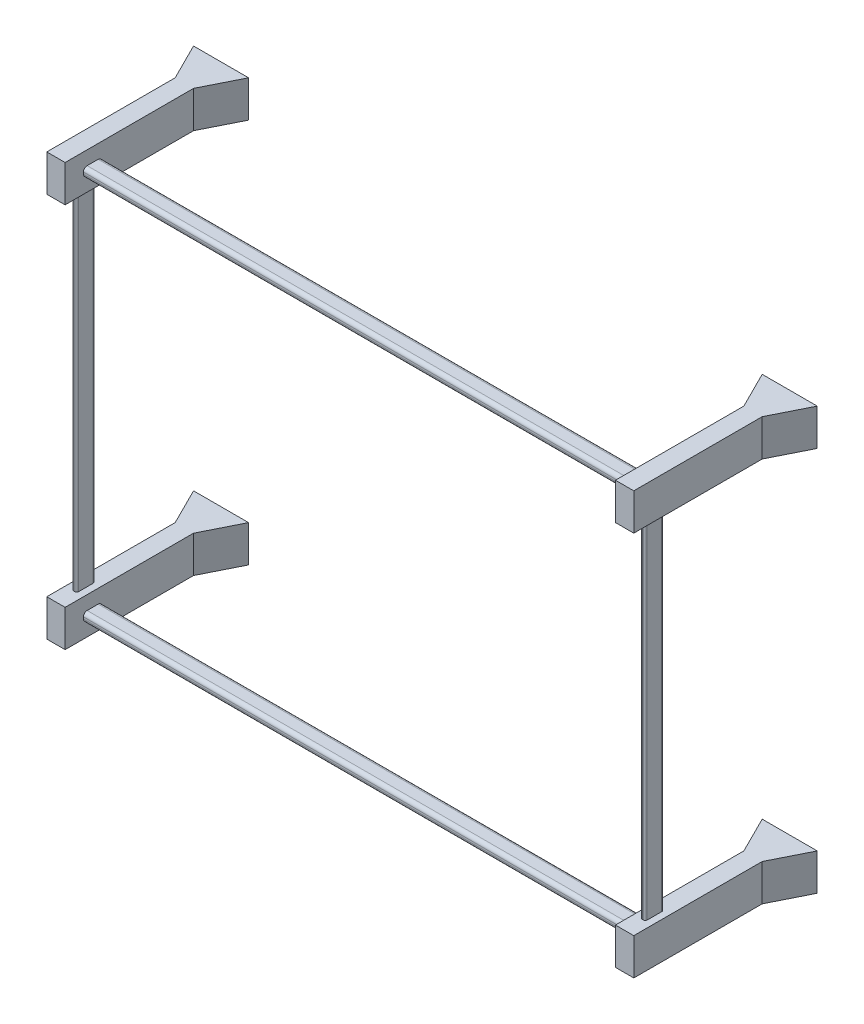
from build123d import *

# Parameters (mm, degrees)
SKETCH1_W                       = 214.285714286
SKETCH1_H                       = 142.857142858
BOSS_EXTRUDE1_DEPTH             = 642.857142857
CUT_EXTRUDE1_DEPTH              = 656.627133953
CUT_EXTRUDE1_DEPTH_BACK         = 656.627133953
SKETCH2_OUTSIDE_W               = 354.792
SKETCH2_OUTSIDE_H               = 783.363
BOSS_EXTRUDE2_DEPTH             = 2142.857142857
SKETCH4_W                       = 642.857142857
SKETCH4_H                       = 142.857142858
BOSS_EXTRUDE3_DEPTH             = 71.428571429
BOSS_EXTRUDE4_REACH             = 2343.125
BOSS_EXTRUDE4_DIRECTION_2_REACH = 2343.125
BOSS_EXTRUDE5_DEPTH             = 1357.14
MIRROR4_COPY_1_SKETCH_W         = 642.857142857
MIRROR4_COPY_1_SKETCH_H         = 142.857142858
MIRROR4_COPY_1_DEPTH            = 71.428571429
MIRROR4_COPY_2_REACH            = 2343.125
MIRROR4_COPY_3_REACH            = 2343.125
MIRROR4_COPY_4_SKETCH_W         = 642.857142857
MIRROR4_COPY_4_SKETCH_H         = 142.857142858
MIRROR4_COPY_4_DEPTH            = 71.428571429
MIRROR4_COPY_5_REACH            = 2343.125
MIRROR4_COPY_6_REACH            = 2343.125


with BuildPart() as part:
    # Sketch1 → Boss-Extrude1 (new body)
    with BuildSketch(Plane.XY):
        Rectangle(SKETCH1_W, SKETCH1_H)
    extrude(amount=BOSS_EXTRUDE1_DEPTH)

    # Sketch2 outside → Cut-Extrude1 (cut, two sides: drawn at the far end of the back side and taken through both)
    with BuildSketch(Plane(origin=(0, 0, 0), x_dir=(1, 0, 0), z_dir=(0, 1, 0)).offset(-CUT_EXTRUDE1_DEPTH_BACK)):
        with Locations((0, -321.4285)):
            Rectangle(SKETCH2_OUTSIDE_W, SKETCH2_OUTSIDE_H)
        Polygon((-107.142857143, 0), (107.142857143, 0), (35.714285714, -142.857142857), (35.714285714, -642.857142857), (-35.714285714, -642.857142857), (-35.714285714, -142.857142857), align=None, mode=Mode.SUBTRACT)
    extrude(amount=CUT_EXTRUDE1_DEPTH + CUT_EXTRUDE1_DEPTH_BACK, mode=Mode.SUBTRACT)


with BuildPart() as boss_extrude2_tool:
    # Sketch3 → Boss-Extrude2 (new body)
    with BuildSketch(Plane(origin=(35.71429, 0, 0), x_dir=(0, 0, -1), z_dir=(1, 0, 0))):
        with BuildLine():
            Line((-514.285714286, -17.857142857), (-557.142857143, -17.857142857))
            ThreePointArc((-557.142857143, -17.857142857), (-567.244382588, -13.672954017), (-571.428571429, -3.571428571))
            Line((-571.428571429, -3.571428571), (-571.428571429, 3.571428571))
            ThreePointArc((-571.428571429, 3.571428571), (-567.244382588, 13.672954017), (-557.142857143, 17.857142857))
            Line((-557.142857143, 17.857142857), (-514.285714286, 17.857142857))
            ThreePointArc((-514.285714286, 17.857142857), (-504.18418884, 13.672954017), (-500, 3.571428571))
            Line((-500, 3.571428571), (-500, -3.571428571))
            ThreePointArc((-500, -3.571428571), (-504.18418884, -13.672954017), (-514.285714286, -17.857142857))
        make_face()
    boss_extrude2 = extrude(amount=BOSS_EXTRUDE2_DEPTH)


with BuildPart() as part_1:
    add(part.part)


with BuildPart() as part_2:
    # Boss-Extrude2: joined with boss_extrude2_tool
    add(part_1.part.fuse(boss_extrude2_tool.part, tol=0.00001))

    # Sketch4 → Boss-Extrude3 (add)
    with BuildSketch(Plane(origin=(2178.57143, 0, 0), x_dir=(0, 0, -1), z_dir=(1, 0, 0))):
        with Locations((-321.428571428, 0)):
            Rectangle(SKETCH4_W, SKETCH4_H)
    boss_extrude3 = extrude(amount=BOSS_EXTRUDE3_DEPTH)

    # Boss-Extrude4: up to this face of the body (flat: up to its plane)
    boss_extrude4_end = Plane(part_2.part.faces().sort_by_distance((2214.285715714, 71.428571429, 321.428571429))[0])
    # Sketch5 → Boss-Extrude4 (add, up to the picked face)
    with BuildSketch(Plane(origin=(0, 0, 0), x_dir=(1, 0, 0), z_dir=(0, 1, 0)), mode=Mode.PRIVATE) as boss_extrude4_sk1:
        Polygon((2250.000001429, 0), (2250.000001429, -142.857142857), (2321.428572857, 0), align=None)
    boss_extrude4_tool1 = split(extrude(boss_extrude4_sk1.sketch, amount=BOSS_EXTRUDE4_REACH, mode=Mode.PRIVATE), bisect_by=boss_extrude4_end, keep=Keep.BOTH, mode=Mode.PRIVATE)
    # Sketch5 → Boss-Extrude4 (add, up to the picked face)
    with BuildSketch(Plane(origin=(0, 0, 0), x_dir=(1, 0, 0), z_dir=(0, 1, 0)), mode=Mode.PRIVATE) as boss_extrude4_sk2:
        Polygon((2178.57143, -142.857142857), (2107.142858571, 0), (2178.57143, 0), align=None)
    boss_extrude4_tool2 = split(extrude(boss_extrude4_sk2.sketch, amount=BOSS_EXTRUDE4_REACH, mode=Mode.PRIVATE), bisect_by=boss_extrude4_end, keep=Keep.BOTH, mode=Mode.PRIVATE)
    boss_extrude4_1 = boss_extrude4_tool1.solids().sort_by(Axis((2273.809525, 0, 47.619048), (0, 1, 0)))[0]
    add(boss_extrude4_1)
    boss_extrude4_2 = boss_extrude4_tool2.solids().sort_by(Axis((2154.761906, 0, 47.619048), (0, 1, 0)))[0]
    add(boss_extrude4_2)
    boss_extrude4 = boss_extrude4_1 + boss_extrude4_2  # Boss-Extrude4 as one shape, for the pattern or mirror that repeats it

    # Boss-Extrude4 direction 2: up to this face of the body (flat: up to its plane)
    boss_extrude4_direction_2_end = Plane(part_2.part.faces().sort_by_distance((2214.285715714, -71.428571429, 321.428571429))[0])
    # Sketch5 → Boss-Extrude4 direction 2 (add, up to the picked face)
    with BuildSketch(Plane(origin=(0, 0, 0), x_dir=(1, 0, 0), z_dir=(0, 1, 0)), mode=Mode.PRIVATE) as boss_extrude4_direction_2_sk1:
        Polygon((2250.000001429, 0), (2250.000001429, -142.857142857), (2321.428572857, 0), align=None)
    boss_extrude4_direction_2_tool1 = split(extrude(boss_extrude4_direction_2_sk1.sketch, amount=-BOSS_EXTRUDE4_DIRECTION_2_REACH, mode=Mode.PRIVATE), bisect_by=boss_extrude4_direction_2_end, keep=Keep.BOTH, mode=Mode.PRIVATE)
    # Sketch5 → Boss-Extrude4 direction 2 (add, up to the picked face)
    with BuildSketch(Plane(origin=(0, 0, 0), x_dir=(1, 0, 0), z_dir=(0, 1, 0)), mode=Mode.PRIVATE) as boss_extrude4_direction_2_sk2:
        Polygon((2178.57143, -142.857142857), (2107.142858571, 0), (2178.57143, 0), align=None)
    boss_extrude4_direction_2_tool2 = split(extrude(boss_extrude4_direction_2_sk2.sketch, amount=-BOSS_EXTRUDE4_DIRECTION_2_REACH, mode=Mode.PRIVATE), bisect_by=boss_extrude4_direction_2_end, keep=Keep.BOTH, mode=Mode.PRIVATE)
    boss_extrude4_direction_2_1 = boss_extrude4_direction_2_tool1.solids().sort_by(Axis((2273.809525, 0, 47.619048), (0, -1, 0)))[0]
    add(boss_extrude4_direction_2_1)
    boss_extrude4_direction_2_2 = boss_extrude4_direction_2_tool2.solids().sort_by(Axis((2154.761906, 0, 47.619048), (0, -1, 0)))[0]
    add(boss_extrude4_direction_2_2)
    boss_extrude4_direction_2 = boss_extrude4_direction_2_1 + boss_extrude4_direction_2_2  # Boss-Extrude4 direction 2 as one shape, for the pattern or mirror that repeats it

    # Sketch6 → Boss-Extrude5 (add)
    with BuildSketch(Plane(origin=(0, 71.42857, 0), x_dir=(1, 0, 0), z_dir=(0, 1, 0))):
        with BuildLine():
            Line((2216.364786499, -571.428571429), (2212.20664493, -571.428571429))
            ThreePointArc((2212.20664493, -571.428571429), (2207.155882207, -569.336477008), (2205.063787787, -564.285714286))
            Line((2205.063787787, -564.285714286), (2205.063787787, -507.142857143))
            ThreePointArc((2205.063787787, -507.142857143), (2207.155882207, -502.09209442), (2212.20664493, -500))
            Line((2212.20664493, -500), (2216.364786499, -500))
            ThreePointArc((2216.364786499, -500), (2221.415549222, -502.09209442), (2223.507643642, -507.142857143))
            Line((2223.507643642, -507.142857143), (2223.507643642, -564.285714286))
            ThreePointArc((2223.507643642, -564.285714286), (2221.415549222, -569.336477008), (2216.364786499, -571.428571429))
        make_face()
    boss_extrude5 = extrude(amount=BOSS_EXTRUDE5_DEPTH)

    # Mirror1: Boss-Extrude3, Boss-Extrude4, Boss-Extrude4 direction 2 across plane
    add(boss_extrude3.mirror(Plane.ZX.offset(749.99857)))
    add(boss_extrude4.mirror(Plane.ZX.offset(749.99857)))
    add(boss_extrude4_direction_2.mirror(Plane.ZX.offset(749.99857)))

    # Mirror3: Boss-Extrude2 across plane
    add(boss_extrude2.mirror(Plane.ZX.offset(749.99857)))

    # Mirror4: Boss-Extrude5 across plane
    add(boss_extrude5.mirror(Plane(origin=(1107.14286, 0, 0), x_dir=(0, 0, 1), z_dir=(1, 0, 0))))

    # Mirror4 copy 1 sketch → Mirror4 copy 1 (add)
    with BuildSketch(Plane(origin=(35.71429, 1499.99714, 0), x_dir=(0, 0, -1), z_dir=(-1, 0, 0))):
        with Locations((-321.428571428, 0)):
            Rectangle(MIRROR4_COPY_1_SKETCH_W, MIRROR4_COPY_1_SKETCH_H)
    extrude(amount=MIRROR4_COPY_1_DEPTH)

    # Mirror4 copy 2: up to this face of the body (flat: up to its plane)
    mirror4_copy_2_end = Plane(part_2.part.faces().sort_by_distance((4.286e-06, 1428.568568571, 321.428571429))[0])
    # Mirror4 copy 2 sketch → Mirror4 copy 2 (add, up to the picked face)
    with BuildSketch(Plane(origin=(2214.28572, 1499.99714, 0), x_dir=(-1, 0, 0), z_dir=(0, -1, 0)), mode=Mode.PRIVATE) as mirror4_copy_2_sk1:
        Polygon((2250.000001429, 0), (2250.000001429, -142.857142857), (2321.428572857, 0), align=None)
    mirror4_copy_2_tool1 = split(extrude(mirror4_copy_2_sk1.sketch, amount=MIRROR4_COPY_2_REACH, mode=Mode.PRIVATE), bisect_by=mirror4_copy_2_end, keep=Keep.BOTH, mode=Mode.PRIVATE)
    # Mirror4 copy 2 sketch → Mirror4 copy 2 (add, up to the picked face)
    with BuildSketch(Plane(origin=(2214.28572, 1499.99714, 0), x_dir=(-1, 0, 0), z_dir=(0, -1, 0)), mode=Mode.PRIVATE) as mirror4_copy_2_sk2:
        Polygon((2178.57143, -142.857142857), (2107.142858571, 0), (2178.57143, 0), align=None)
    mirror4_copy_2_tool2 = split(extrude(mirror4_copy_2_sk2.sketch, amount=MIRROR4_COPY_2_REACH, mode=Mode.PRIVATE), bisect_by=mirror4_copy_2_end, keep=Keep.BOTH, mode=Mode.PRIVATE)
    add(mirror4_copy_2_tool1.solids().sort_by(Axis((-59.523805, 1499.99714, 47.619048), (0, -1, 0)))[0])
    add(mirror4_copy_2_tool2.solids().sort_by(Axis((59.523814, 1499.99714, 47.619048), (0, -1, 0)))[0])

    # Mirror4 copy 3: up to this face of the body (flat: up to its plane)
    mirror4_copy_3_end = Plane(part_2.part.faces().sort_by_distance((4.286e-06, 1571.425711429, 321.428571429))[0])
    # Mirror4 copy 3 sketch → Mirror4 copy 3 (add, up to the picked face)
    with BuildSketch(Plane(origin=(2214.28572, 1499.99714, 0), x_dir=(-1, 0, 0), z_dir=(0, -1, 0)), mode=Mode.PRIVATE) as mirror4_copy_3_sk1:
        Polygon((2250.000001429, 0), (2250.000001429, -142.857142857), (2321.428572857, 0), align=None)
    mirror4_copy_3_tool1 = split(extrude(mirror4_copy_3_sk1.sketch, amount=-MIRROR4_COPY_3_REACH, mode=Mode.PRIVATE), bisect_by=mirror4_copy_3_end, keep=Keep.BOTH, mode=Mode.PRIVATE)
    # Mirror4 copy 3 sketch → Mirror4 copy 3 (add, up to the picked face)
    with BuildSketch(Plane(origin=(2214.28572, 1499.99714, 0), x_dir=(-1, 0, 0), z_dir=(0, -1, 0)), mode=Mode.PRIVATE) as mirror4_copy_3_sk2:
        Polygon((2178.57143, -142.857142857), (2107.142858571, 0), (2178.57143, 0), align=None)
    mirror4_copy_3_tool2 = split(extrude(mirror4_copy_3_sk2.sketch, amount=-MIRROR4_COPY_3_REACH, mode=Mode.PRIVATE), bisect_by=mirror4_copy_3_end, keep=Keep.BOTH, mode=Mode.PRIVATE)
    add(mirror4_copy_3_tool1.solids().sort_by(Axis((-59.523805, 1499.99714, 47.619048), (0, 1, 0)))[0])
    add(mirror4_copy_3_tool2.solids().sort_by(Axis((59.523814, 1499.99714, 47.619048), (0, 1, 0)))[0])

    # Mirror4 copy 4 sketch → Mirror4 copy 4 (add)
    with BuildSketch(Plane(origin=(35.71429, 0, 0), x_dir=(0, 0, -1), z_dir=(-1, 0, 0))):
        with Locations((-321.428571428, 0)):
            Rectangle(MIRROR4_COPY_4_SKETCH_W, MIRROR4_COPY_4_SKETCH_H)
    extrude(amount=MIRROR4_COPY_4_DEPTH)

    # Mirror4 copy 5: up to this face of the body (flat: up to its plane)
    mirror4_copy_5_end = Plane(part_2.part.faces().sort_by_distance((4.286e-06, 71.428571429, 321.428571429))[0])
    # Mirror4 copy 5 sketch → Mirror4 copy 5 (add, up to the picked face)
    with BuildSketch(Plane(origin=(2214.28572, 0, 0), x_dir=(-1, 0, 0), z_dir=(0, 1, 0)), mode=Mode.PRIVATE) as mirror4_copy_5_sk1:
        Polygon((2250.000001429, 0), (2250.000001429, 142.857142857), (2321.428572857, 0), align=None)
    mirror4_copy_5_tool1 = split(extrude(mirror4_copy_5_sk1.sketch, amount=MIRROR4_COPY_5_REACH, mode=Mode.PRIVATE), bisect_by=mirror4_copy_5_end, keep=Keep.BOTH, mode=Mode.PRIVATE)
    # Mirror4 copy 5 sketch → Mirror4 copy 5 (add, up to the picked face)
    with BuildSketch(Plane(origin=(2214.28572, 0, 0), x_dir=(-1, 0, 0), z_dir=(0, 1, 0)), mode=Mode.PRIVATE) as mirror4_copy_5_sk2:
        Polygon((2178.57143, 142.857142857), (2107.142858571, 0), (2178.57143, 0), align=None)
    mirror4_copy_5_tool2 = split(extrude(mirror4_copy_5_sk2.sketch, amount=MIRROR4_COPY_5_REACH, mode=Mode.PRIVATE), bisect_by=mirror4_copy_5_end, keep=Keep.BOTH, mode=Mode.PRIVATE)
    add(mirror4_copy_5_tool1.solids().sort_by(Axis((-59.523805, 0, 47.619048), (0, 1, 0)))[0])
    add(mirror4_copy_5_tool2.solids().sort_by(Axis((59.523814, 0, 47.619048), (0, 1, 0)))[0])

    # Mirror4 copy 6: up to this face of the body (flat: up to its plane)
    mirror4_copy_6_end = Plane(part_2.part.faces().sort_by_distance((4.286e-06, -71.428571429, 321.428571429))[0])
    # Mirror4 copy 6 sketch → Mirror4 copy 6 (add, up to the picked face)
    with BuildSketch(Plane(origin=(2214.28572, 0, 0), x_dir=(-1, 0, 0), z_dir=(0, 1, 0)), mode=Mode.PRIVATE) as mirror4_copy_6_sk1:
        Polygon((2250.000001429, 0), (2250.000001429, 142.857142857), (2321.428572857, 0), align=None)
    mirror4_copy_6_tool1 = split(extrude(mirror4_copy_6_sk1.sketch, amount=-MIRROR4_COPY_6_REACH, mode=Mode.PRIVATE), bisect_by=mirror4_copy_6_end, keep=Keep.BOTH, mode=Mode.PRIVATE)
    # Mirror4 copy 6 sketch → Mirror4 copy 6 (add, up to the picked face)
    with BuildSketch(Plane(origin=(2214.28572, 0, 0), x_dir=(-1, 0, 0), z_dir=(0, 1, 0)), mode=Mode.PRIVATE) as mirror4_copy_6_sk2:
        Polygon((2178.57143, 142.857142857), (2107.142858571, 0), (2178.57143, 0), align=None)
    mirror4_copy_6_tool2 = split(extrude(mirror4_copy_6_sk2.sketch, amount=-MIRROR4_COPY_6_REACH, mode=Mode.PRIVATE), bisect_by=mirror4_copy_6_end, keep=Keep.BOTH, mode=Mode.PRIVATE)
    add(mirror4_copy_6_tool1.solids().sort_by(Axis((-59.523805, 0, 47.619048), (0, -1, 0)))[0])
    add(mirror4_copy_6_tool2.solids().sort_by(Axis((59.523814, 0, 47.619048), (0, -1, 0)))[0])


solid = part_2.part
